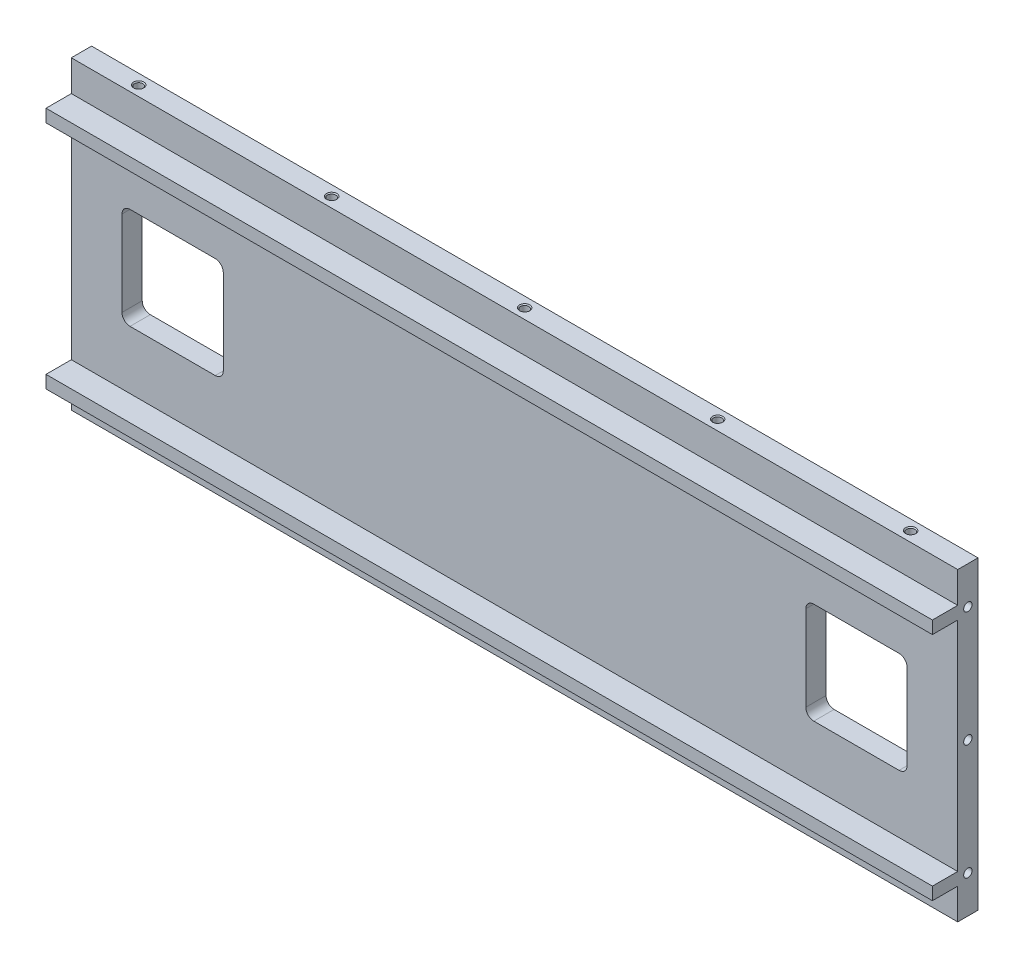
from build123d import *

# Parameters (mm, degrees)
SKETCH1_W           = 350
SKETCH1_H           = 120.5
BOSS_EXTRUDE1_DEPTH = 8
SKETCH2_W           = 350
SKETCH2_H           = 5
BOSS_EXTRUDE2_DEPTH = 10
CUT_EXTRUDE1_REACH  = 187.351
LPATTERN4_COUNT     = 5
LPATTERN4_PITCH     = 76.2
LPATTERN3_COUNT     = 2
LPATTERN3_PITCH     = 45.5
LPATTERN3_COL_COUNT = 2
LPATTERN3_COL_PITCH = 45.5


with BuildPart() as part:
    # Sketch1 → Boss-Extrude1 (new body)
    with BuildSketch(Plane.XY):
        Rectangle(SKETCH1_W, SKETCH1_H)
    extrude(amount=BOSS_EXTRUDE1_DEPTH)

    # Sketch2 → Boss-Extrude2 (add)
    with BuildSketch(Plane.XY.offset(8)):
        with Locations((0, 45.5)):
            Rectangle(SKETCH2_W, SKETCH2_H)
    boss_extrude2 = extrude(amount=BOSS_EXTRUDE2_DEPTH)

    # Sketch11 → Cut-Extrude1 (cut, up to next)
    with BuildSketch(Plane.XY.offset(8), mode=Mode.PRIVATE) as cut_extrude1_sk1:
        with BuildLine():
            Line((118.175, 20), (151.825, 20))
            ThreePointArc((151.825, 20), (154.07006403, 19.07006403), (155, 16.825))
            Line((155, 16.825), (155, -16.825))
            ThreePointArc((155, -16.825), (154.07006403, -19.07006403), (151.825, -20))
            Line((151.825, -20), (118.175, -20))
            ThreePointArc((118.175, -20), (115.92993597, -19.07006403), (115, -16.825))
            Line((115, -16.825), (115, 16.825))
            ThreePointArc((115, 16.825), (115.92993597, 19.07006403), (118.175, 20))
        make_face()
    cut_extrude1_tool1 = extrude(cut_extrude1_sk1.sketch, amount=-CUT_EXTRUDE1_REACH, mode=Mode.PRIVATE) & part.part
    cut_extrude1 = cut_extrude1_tool1.solids().sort_by_distance((135, 0, 8))[0]
    add(cut_extrude1, mode=Mode.SUBTRACT)

    # Sketch13 → M4x0.7 Tapped Hole2 (revolve, cut)
    with BuildSketch(Plane(origin=(152.4, 60.25, 4), x_dir=(0, 0, 1), z_dir=(1, 0, 0))):
        Polygon((0, 0), (0, 14.991420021), (1.65, 14), (1.65, 0.375), (2.025, 0), align=None)
    m4x0_7_tapped_hole2 = revolve(axis=Axis((152.4, 66.6, 4), (0, -1, 0)), mode=Mode.SUBTRACT)

    # LPattern4: M4x0.7 Tapped Hole2 ×5
    with Locations(*[(-i * LPATTERN4_PITCH, 0, 0) for i in range(1, LPATTERN4_COUNT)]):
        add(m4x0_7_tapped_hole2, mode=Mode.SUBTRACT)

    # Mirror4: Boss-Extrude2, M4x0.7 Tapped Hole2 across plane
    add(boss_extrude2.mirror(Plane.ZX))
    add(m4x0_7_tapped_hole2.mirror(Plane.ZX), mode=Mode.SUBTRACT)

    # Mirror4 copy 1 sketch → Mirror4 copy 1 (revolve, cut)
    with BuildSketch(Plane(origin=(76.2, -60.25, 4), x_dir=(0, 0, 1), z_dir=(1, 0, 0))):
        Polygon((0, 0), (0, -14.991420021), (1.65, -14), (1.65, -0.375), (2.025, 0), align=None)
    revolve(axis=Axis((76.2, -66.6, 4), (0, -1, 0)), mode=Mode.SUBTRACT)

    # Mirror4 copy 2 sketch → Mirror4 copy 2 (revolve, cut)
    with BuildSketch(Plane(origin=(0, -60.25, 4), x_dir=(0, 0, 1), z_dir=(1, 0, 0))):
        Polygon((0, 0), (0, -14.991420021), (1.65, -14), (1.65, -0.375), (2.025, 0), align=None)
    revolve(axis=Axis((0, -66.6, 4), (0, -1, 0)), mode=Mode.SUBTRACT)

    # Mirror4 copy 3 sketch → Mirror4 copy 3 (revolve, cut)
    with BuildSketch(Plane(origin=(-76.2, -60.25, 4), x_dir=(0, 0, 1), z_dir=(1, 0, 0))):
        Polygon((0, 0), (0, -14.991420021), (1.65, -14), (1.65, -0.375), (2.025, 0), align=None)
    revolve(axis=Axis((-76.2, -66.6, 4), (0, -1, 0)), mode=Mode.SUBTRACT)

    # Mirror4 copy 4 sketch → Mirror4 copy 4 (revolve, cut)
    with BuildSketch(Plane(origin=(-152.4, -60.25, 4), x_dir=(0, 0, 1), z_dir=(1, 0, 0))):
        Polygon((0, 0), (0, -14.991420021), (1.65, -14), (1.65, -0.375), (2.025, 0), align=None)
    revolve(axis=Axis((-152.4, -66.6, 4), (0, -1, 0)), mode=Mode.SUBTRACT)

    # Sketch10 → M4x0.7 Tapped Hole1 (revolve, cut)
    with BuildSketch(Plane(origin=(175, 0, 4), x_dir=(0, 0, -1), z_dir=(0, 1, 0))):
        Polygon((0, 0), (0, 14.991420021), (1.65, 14), (1.65, 0), align=None)
    m4x0_7_tapped_hole1 = revolve(axis=Axis((181.35, 0, 4), (-1, 0, 0)), mode=Mode.SUBTRACT)

    # LPattern3: M4x0.7 Tapped Hole1 ×2
    with Locations(*[(0, i * LPATTERN3_PITCH, 0) for i in range(1, LPATTERN3_COUNT)]):
        add(m4x0_7_tapped_hole1, mode=Mode.SUBTRACT)

    # LPattern3 col: M4x0.7 Tapped Hole1 ×2
    with Locations(*[(0, -i * LPATTERN3_COL_PITCH, 0) for i in range(1, LPATTERN3_COL_COUNT)]):
        add(m4x0_7_tapped_hole1, mode=Mode.SUBTRACT)

    # Mirror2: Cut-Extrude1, M4x0.7 Tapped Hole1 across plane
    add(cut_extrude1.mirror(Plane(origin=(0, 0, 0), x_dir=(0, 0, 1), z_dir=(1, 0, 0))), mode=Mode.SUBTRACT)
    add(m4x0_7_tapped_hole1.mirror(Plane(origin=(0, 0, 0), x_dir=(0, 0, 1), z_dir=(1, 0, 0))), mode=Mode.SUBTRACT)

    # Mirror2 copy 1 sketch → Mirror2 copy 1 (revolve, cut)
    with BuildSketch(Plane(origin=(-175, 45.5, 4), x_dir=(0, 0, -1), z_dir=(0, 1, 0))):
        Polygon((0, 0), (0, -14.991420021), (1.65, -14), (1.65, 0), align=None)
    revolve(axis=Axis((-181.35, 45.5, 4), (-1, 0, 0)), mode=Mode.SUBTRACT)

    # Mirror2 copy 2 sketch → Mirror2 copy 2 (revolve, cut)
    with BuildSketch(Plane(origin=(-175, -45.5, 4), x_dir=(0, 0, -1), z_dir=(0, 1, 0))):
        Polygon((0, 0), (0, -14.991420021), (1.65, -14), (1.65, 0), align=None)
    revolve(axis=Axis((-181.35, -45.5, 4), (-1, 0, 0)), mode=Mode.SUBTRACT)


solid = part.part
